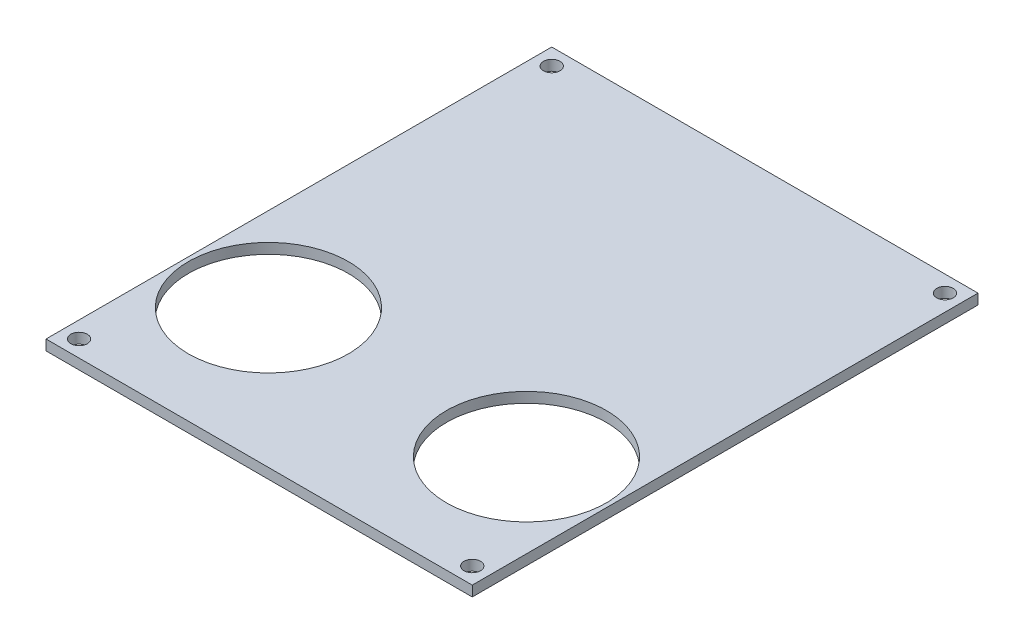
ISO-10303-21;
HEADER;
FILE_DESCRIPTION(('STEP AP214'),'2;1');
FILE_NAME('part.step','',(''),(''),'','','');
FILE_SCHEMA(('AUTOMOTIVE_DESIGN { 1 0 10303 214 1 1 1 1 }'));
ENDSEC;
DATA;
#1=APPLICATION_CONTEXT('core data for automotive mechanical design processes');
#2=APPLICATION_PROTOCOL_DEFINITION('international standard','automotive_design',2000,#1);
#3=PRODUCT_CONTEXT('',#1,'mechanical');
#4=PRODUCT('Part','Part','',(#3));
#5=PRODUCT_RELATED_PRODUCT_CATEGORY('part','',(#4));
#6=PRODUCT_DEFINITION_FORMATION('','',#4);
#7=PRODUCT_DEFINITION_CONTEXT('part definition',#1,'design');
#8=PRODUCT_DEFINITION('design','',#6,#7);
#9=PRODUCT_DEFINITION_SHAPE('','',#8);
#10=(LENGTH_UNIT() NAMED_UNIT(*) SI_UNIT(.MILLI.,.METRE.));
#11=(NAMED_UNIT(*) PLANE_ANGLE_UNIT() SI_UNIT($,.RADIAN.));
#12=(NAMED_UNIT(*) SI_UNIT($,.STERADIAN.) SOLID_ANGLE_UNIT());
#13=UNCERTAINTY_MEASURE_WITH_UNIT(LENGTH_MEASURE(1.E-05),#10,'distance_accuracy_value','');
#14=(GEOMETRIC_REPRESENTATION_CONTEXT(3) GLOBAL_UNCERTAINTY_ASSIGNED_CONTEXT((#13)) GLOBAL_UNIT_ASSIGNED_CONTEXT((#10,
#11,#12)) REPRESENTATION_CONTEXT('',''));
#15=CARTESIAN_POINT('',(0.,0.,0.));
#16=DIRECTION('',(0.,0.,1.));
#17=DIRECTION('',(1.,0.,0.));
#18=AXIS2_PLACEMENT_3D('',#15,#16,#17);
#19=CARTESIAN_POINT('',(-41.3,2.,-49.));
#20=DIRECTION('',(1.,0.,0.));
#21=DIRECTION('',(0.,0.,-1.));
#22=AXIS2_PLACEMENT_3D('',#19,#20,#21);
#23=PLANE('',#22);
#24=DIRECTION('',(0.,0.,1.));
#25=VECTOR('',#24,1.);
#26=CARTESIAN_POINT('',(-41.3,0.,-49.));
#27=LINE('',#26,#25);
#28=CARTESIAN_POINT('',(-41.3,0.,-49.));
#29=VERTEX_POINT('',#28);
#30=CARTESIAN_POINT('',(-41.3,0.,49.));
#31=VERTEX_POINT('',#30);
#32=EDGE_CURVE('E96',#29,#31,#27,.T.);
#33=ORIENTED_EDGE('',*,*,#32,.T.);
#34=DIRECTION('',(0.,-1.,0.));
#35=VECTOR('',#34,1.);
#36=CARTESIAN_POINT('',(-41.3,2.,49.));
#37=LINE('',#36,#35);
#38=CARTESIAN_POINT('',(-41.3,2.,49.));
#39=VERTEX_POINT('',#38);
#40=EDGE_CURVE('E11',#39,#31,#37,.T.);
#41=ORIENTED_EDGE('',*,*,#40,.F.);
#42=DIRECTION('',(0.,0.,1.));
#43=VECTOR('',#42,1.);
#44=CARTESIAN_POINT('',(-41.3,2.,-49.));
#45=LINE('',#44,#43);
#46=CARTESIAN_POINT('',(-41.3,2.,-49.));
#47=VERTEX_POINT('',#46);
#48=EDGE_CURVE('E84',#47,#39,#45,.T.);
#49=ORIENTED_EDGE('',*,*,#48,.F.);
#50=DIRECTION('',(0.,-1.,0.));
#51=VECTOR('',#50,1.);
#52=CARTESIAN_POINT('',(-41.3,2.,-49.));
#53=LINE('',#52,#51);
#54=EDGE_CURVE('E92',#47,#29,#53,.T.);
#55=ORIENTED_EDGE('',*,*,#54,.T.);
#56=EDGE_LOOP('',(#33,#41,#49,#55));
#57=FACE_BOUND('',#56,.T.);
#58=ADVANCED_FACE('F33',(#57),#23,.F.);
#59=CARTESIAN_POINT('',(41.3,2.,49.));
#60=DIRECTION('',(0.,0.,-1.));
#61=DIRECTION('',(-1.,0.,0.));
#62=AXIS2_PLACEMENT_3D('',#59,#60,#61);
#63=PLANE('',#62);
#64=DIRECTION('',(1.,0.,0.));
#65=VECTOR('',#64,1.);
#66=CARTESIAN_POINT('',(41.3,0.,49.));
#67=LINE('',#66,#65);
#68=CARTESIAN_POINT('',(41.3,0.,49.));
#69=VERTEX_POINT('',#68);
#70=EDGE_CURVE('E88',#31,#69,#67,.T.);
#71=ORIENTED_EDGE('',*,*,#70,.T.);
#72=DIRECTION('',(0.,-1.,0.));
#73=VECTOR('',#72,1.);
#74=CARTESIAN_POINT('',(41.3,2.,49.));
#75=LINE('',#74,#73);
#76=CARTESIAN_POINT('',(41.3,2.,49.));
#77=VERTEX_POINT('',#76);
#78=EDGE_CURVE('E41',#77,#69,#75,.T.);
#79=ORIENTED_EDGE('',*,*,#78,.F.);
#80=DIRECTION('',(1.,0.,0.));
#81=VECTOR('',#80,1.);
#82=CARTESIAN_POINT('',(41.3,2.,49.));
#83=LINE('',#82,#81);
#84=EDGE_CURVE('E79',#39,#77,#83,.T.);
#85=ORIENTED_EDGE('',*,*,#84,.F.);
#86=ORIENTED_EDGE('',*,*,#40,.T.);
#87=EDGE_LOOP('',(#71,#79,#85,#86));
#88=FACE_BOUND('',#87,.T.);
#89=ADVANCED_FACE('F87',(#88),#63,.F.);
#90=CARTESIAN_POINT('',(41.3,2.,-49.));
#91=DIRECTION('',(-1.,0.,0.));
#92=DIRECTION('',(0.,0.,1.));
#93=AXIS2_PLACEMENT_3D('',#90,#91,#92);
#94=PLANE('',#93);
#95=DIRECTION('',(0.,0.,-1.));
#96=VECTOR('',#95,1.);
#97=CARTESIAN_POINT('',(41.3,0.,-49.));
#98=LINE('',#97,#96);
#99=CARTESIAN_POINT('',(41.3,0.,-49.));
#100=VERTEX_POINT('',#99);
#101=EDGE_CURVE('E66',#69,#100,#98,.T.);
#102=ORIENTED_EDGE('',*,*,#101,.T.);
#103=DIRECTION('',(0.,-1.,0.));
#104=VECTOR('',#103,1.);
#105=CARTESIAN_POINT('',(41.3,2.,-49.));
#106=LINE('',#105,#104);
#107=CARTESIAN_POINT('',(41.3,2.,-49.));
#108=VERTEX_POINT('',#107);
#109=EDGE_CURVE('E89',#108,#100,#106,.T.);
#110=ORIENTED_EDGE('',*,*,#109,.F.);
#111=DIRECTION('',(0.,0.,-1.));
#112=VECTOR('',#111,1.);
#113=CARTESIAN_POINT('',(41.3,2.,-49.));
#114=LINE('',#113,#112);
#115=EDGE_CURVE('E82',#77,#108,#114,.T.);
#116=ORIENTED_EDGE('',*,*,#115,.F.);
#117=ORIENTED_EDGE('',*,*,#78,.T.);
#118=EDGE_LOOP('',(#102,#110,#116,#117));
#119=FACE_BOUND('',#118,.T.);
#120=ADVANCED_FACE('F90',(#119),#94,.F.);
#121=CARTESIAN_POINT('',(41.3,2.,-49.));
#122=DIRECTION('',(0.,0.,1.));
#123=DIRECTION('',(1.,0.,0.));
#124=AXIS2_PLACEMENT_3D('',#121,#122,#123);
#125=PLANE('',#124);
#126=DIRECTION('',(-1.,0.,0.));
#127=VECTOR('',#126,1.);
#128=CARTESIAN_POINT('',(41.3,0.,-49.));
#129=LINE('',#128,#127);
#130=EDGE_CURVE('E72',#100,#29,#129,.T.);
#131=ORIENTED_EDGE('',*,*,#130,.T.);
#132=ORIENTED_EDGE('',*,*,#54,.F.);
#133=DIRECTION('',(-1.,0.,0.));
#134=VECTOR('',#133,1.);
#135=CARTESIAN_POINT('',(41.3,2.,-49.));
#136=LINE('',#135,#134);
#137=EDGE_CURVE('E49',#108,#47,#136,.T.);
#138=ORIENTED_EDGE('',*,*,#137,.F.);
#139=ORIENTED_EDGE('',*,*,#109,.T.);
#140=EDGE_LOOP('',(#131,#132,#138,#139));
#141=FACE_BOUND('',#140,.T.);
#142=ADVANCED_FACE('F104',(#141),#125,.F.);
#143=CARTESIAN_POINT('',(0.,2.,0.));
#144=DIRECTION('',(0.,-1.,0.));
#145=DIRECTION('',(0.,0.,-1.));
#146=AXIS2_PLACEMENT_3D('',#143,#144,#145);
#147=PLANE('',#146);
#148=CARTESIAN_POINT('',(25.,2.,22.2));
#149=DIRECTION('',(0.,1.,0.));
#150=DIRECTION('',(0.,0.,1.));
#151=AXIS2_PLACEMENT_3D('',#148,#149,#150);
#152=CIRCLE('',#151,15.5);
#153=CARTESIAN_POINT('',(25.,2.,37.7));
#154=VERTEX_POINT('',#153);
#155=EDGE_CURVE('E140',#154,#154,#152,.T.);
#156=ORIENTED_EDGE('',*,*,#155,.F.);
#157=EDGE_LOOP('',(#156));
#158=FACE_BOUND('',#157,.T.);
#159=CARTESIAN_POINT('',(-25.,2.,22.2));
#160=DIRECTION('',(0.,1.,0.));
#161=DIRECTION('',(0.,0.,1.));
#162=AXIS2_PLACEMENT_3D('',#159,#160,#161);
#163=CIRCLE('',#162,15.5);
#164=CARTESIAN_POINT('',(-25.,2.,37.7));
#165=VERTEX_POINT('',#164);
#166=EDGE_CURVE('E134',#165,#165,#163,.T.);
#167=ORIENTED_EDGE('',*,*,#166,.F.);
#168=EDGE_LOOP('',(#167));
#169=FACE_BOUND('',#168,.T.);
#170=CARTESIAN_POINT('',(-38.1,2.,-45.8));
#171=DIRECTION('',(0.,1.,0.));
#172=DIRECTION('',(0.,0.,1.));
#173=AXIS2_PLACEMENT_3D('',#170,#171,#172);
#174=CIRCLE('',#173,1.59999999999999);
#175=CARTESIAN_POINT('',(-38.1,2.,-44.2));
#176=VERTEX_POINT('',#175);
#177=EDGE_CURVE('E130',#176,#176,#174,.T.);
#178=ORIENTED_EDGE('',*,*,#177,.F.);
#179=EDGE_LOOP('',(#178));
#180=FACE_BOUND('',#179,.T.);
#181=CARTESIAN_POINT('',(38.1,2.,-45.8));
#182=DIRECTION('',(0.,1.,0.));
#183=DIRECTION('',(0.,0.,1.));
#184=AXIS2_PLACEMENT_3D('',#181,#182,#183);
#185=CIRCLE('',#184,1.59999999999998);
#186=CARTESIAN_POINT('',(38.1,2.,-44.2));
#187=VERTEX_POINT('',#186);
#188=EDGE_CURVE('E124',#187,#187,#185,.T.);
#189=ORIENTED_EDGE('',*,*,#188,.F.);
#190=EDGE_LOOP('',(#189));
#191=FACE_BOUND('',#190,.T.);
#192=CARTESIAN_POINT('',(38.1,2.,45.8));
#193=DIRECTION('',(0.,1.,0.));
#194=DIRECTION('',(0.,0.,1.));
#195=AXIS2_PLACEMENT_3D('',#192,#193,#194);
#196=CIRCLE('',#195,1.59999999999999);
#197=CARTESIAN_POINT('',(38.1,2.,47.4));
#198=VERTEX_POINT('',#197);
#199=EDGE_CURVE('E118',#198,#198,#196,.T.);
#200=ORIENTED_EDGE('',*,*,#199,.F.);
#201=EDGE_LOOP('',(#200));
#202=FACE_BOUND('',#201,.T.);
#203=CARTESIAN_POINT('',(-38.1,2.,45.8));
#204=DIRECTION('',(0.,1.,0.));
#205=DIRECTION('',(0.,0.,1.));
#206=AXIS2_PLACEMENT_3D('',#203,#204,#205);
#207=CIRCLE('',#206,1.59999999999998);
#208=CARTESIAN_POINT('',(-38.1,2.,47.4));
#209=VERTEX_POINT('',#208);
#210=EDGE_CURVE('E112',#209,#209,#207,.T.);
#211=ORIENTED_EDGE('',*,*,#210,.F.);
#212=EDGE_LOOP('',(#211));
#213=FACE_BOUND('',#212,.T.);
#214=ORIENTED_EDGE('',*,*,#48,.T.);
#215=ORIENTED_EDGE('',*,*,#84,.T.);
#216=ORIENTED_EDGE('',*,*,#115,.T.);
#217=ORIENTED_EDGE('',*,*,#137,.T.);
#218=EDGE_LOOP('',(#214,#215,#216,#217));
#219=FACE_BOUND('',#218,.T.);
#220=ADVANCED_FACE('F80',(#158,#169,#180,#191,#202,#213,#219),#147,.F.);
#221=CARTESIAN_POINT('',(0.,0.,0.));
#222=DIRECTION('',(0.,-1.,0.));
#223=DIRECTION('',(0.,0.,-1.));
#224=AXIS2_PLACEMENT_3D('',#221,#222,#223);
#225=PLANE('',#224);
#226=CARTESIAN_POINT('',(25.,0.,22.2));
#227=DIRECTION('',(0.,1.,0.));
#228=DIRECTION('',(0.,0.,1.));
#229=AXIS2_PLACEMENT_3D('',#226,#227,#228);
#230=CIRCLE('',#229,15.5);
#231=CARTESIAN_POINT('',(25.,0.,37.7));
#232=VERTEX_POINT('',#231);
#233=EDGE_CURVE('E137',#232,#232,#230,.T.);
#234=ORIENTED_EDGE('',*,*,#233,.T.);
#235=EDGE_LOOP('',(#234));
#236=FACE_BOUND('',#235,.T.);
#237=CARTESIAN_POINT('',(-25.,0.,22.2));
#238=DIRECTION('',(0.,1.,0.));
#239=DIRECTION('',(0.,0.,1.));
#240=AXIS2_PLACEMENT_3D('',#237,#238,#239);
#241=CIRCLE('',#240,15.5);
#242=CARTESIAN_POINT('',(-25.,0.,37.7));
#243=VERTEX_POINT('',#242);
#244=EDGE_CURVE('E133',#243,#243,#241,.T.);
#245=ORIENTED_EDGE('',*,*,#244,.T.);
#246=EDGE_LOOP('',(#245));
#247=FACE_BOUND('',#246,.T.);
#248=CARTESIAN_POINT('',(-38.1,0.,-45.8));
#249=DIRECTION('',(0.,1.,0.));
#250=DIRECTION('',(0.,0.,1.));
#251=AXIS2_PLACEMENT_3D('',#248,#249,#250);
#252=CIRCLE('',#251,1.59999999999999);
#253=CARTESIAN_POINT('',(-38.1,0.,-44.2));
#254=VERTEX_POINT('',#253);
#255=EDGE_CURVE('E127',#254,#254,#252,.T.);
#256=ORIENTED_EDGE('',*,*,#255,.T.);
#257=EDGE_LOOP('',(#256));
#258=FACE_BOUND('',#257,.T.);
#259=CARTESIAN_POINT('',(38.1,0.,-45.8));
#260=DIRECTION('',(0.,1.,0.));
#261=DIRECTION('',(0.,0.,1.));
#262=AXIS2_PLACEMENT_3D('',#259,#260,#261);
#263=CIRCLE('',#262,1.59999999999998);
#264=CARTESIAN_POINT('',(38.1,0.,-44.2));
#265=VERTEX_POINT('',#264);
#266=EDGE_CURVE('E121',#265,#265,#263,.T.);
#267=ORIENTED_EDGE('',*,*,#266,.T.);
#268=EDGE_LOOP('',(#267));
#269=FACE_BOUND('',#268,.T.);
#270=CARTESIAN_POINT('',(38.1,0.,45.8));
#271=DIRECTION('',(0.,1.,0.));
#272=DIRECTION('',(0.,0.,1.));
#273=AXIS2_PLACEMENT_3D('',#270,#271,#272);
#274=CIRCLE('',#273,1.59999999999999);
#275=CARTESIAN_POINT('',(38.1,0.,47.4));
#276=VERTEX_POINT('',#275);
#277=EDGE_CURVE('E115',#276,#276,#274,.T.);
#278=ORIENTED_EDGE('',*,*,#277,.T.);
#279=EDGE_LOOP('',(#278));
#280=FACE_BOUND('',#279,.T.);
#281=CARTESIAN_POINT('',(-38.1,0.,45.8));
#282=DIRECTION('',(0.,1.,0.));
#283=DIRECTION('',(0.,0.,1.));
#284=AXIS2_PLACEMENT_3D('',#281,#282,#283);
#285=CIRCLE('',#284,1.59999999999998);
#286=CARTESIAN_POINT('',(-38.1,0.,47.4));
#287=VERTEX_POINT('',#286);
#288=EDGE_CURVE('E99',#287,#287,#285,.T.);
#289=ORIENTED_EDGE('',*,*,#288,.T.);
#290=EDGE_LOOP('',(#289));
#291=FACE_BOUND('',#290,.T.);
#292=ORIENTED_EDGE('',*,*,#32,.F.);
#293=ORIENTED_EDGE('',*,*,#130,.F.);
#294=ORIENTED_EDGE('',*,*,#101,.F.);
#295=ORIENTED_EDGE('',*,*,#70,.F.);
#296=EDGE_LOOP('',(#292,#293,#294,#295));
#297=FACE_BOUND('',#296,.T.);
#298=ADVANCED_FACE('F107',(#236,#247,#258,#269,#280,#291,#297),#225,.T.);
#299=CARTESIAN_POINT('',(-38.1,2.,45.8));
#300=DIRECTION('',(0.,1.,0.));
#301=DIRECTION('',(0.,0.,1.));
#302=AXIS2_PLACEMENT_3D('',#299,#300,#301);
#303=CYLINDRICAL_SURFACE('',#302,1.59999999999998);
#304=ORIENTED_EDGE('',*,*,#288,.F.);
#305=EDGE_LOOP('',(#304));
#306=FACE_BOUND('',#305,.T.);
#307=ORIENTED_EDGE('',*,*,#210,.T.);
#308=EDGE_LOOP('',(#307));
#309=FACE_BOUND('',#308,.T.);
#310=ADVANCED_FACE('F168',(#306,#309),#303,.F.);
#311=CARTESIAN_POINT('',(38.1,2.,45.8));
#312=DIRECTION('',(0.,1.,0.));
#313=DIRECTION('',(0.,0.,1.));
#314=AXIS2_PLACEMENT_3D('',#311,#312,#313);
#315=CYLINDRICAL_SURFACE('',#314,1.59999999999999);
#316=ORIENTED_EDGE('',*,*,#277,.F.);
#317=EDGE_LOOP('',(#316));
#318=FACE_BOUND('',#317,.T.);
#319=ORIENTED_EDGE('',*,*,#199,.T.);
#320=EDGE_LOOP('',(#319));
#321=FACE_BOUND('',#320,.T.);
#322=ADVANCED_FACE('F170',(#318,#321),#315,.F.);
#323=CARTESIAN_POINT('',(38.1,2.,-45.8));
#324=DIRECTION('',(0.,1.,0.));
#325=DIRECTION('',(0.,0.,1.));
#326=AXIS2_PLACEMENT_3D('',#323,#324,#325);
#327=CYLINDRICAL_SURFACE('',#326,1.59999999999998);
#328=ORIENTED_EDGE('',*,*,#266,.F.);
#329=EDGE_LOOP('',(#328));
#330=FACE_BOUND('',#329,.T.);
#331=ORIENTED_EDGE('',*,*,#188,.T.);
#332=EDGE_LOOP('',(#331));
#333=FACE_BOUND('',#332,.T.);
#334=ADVANCED_FACE('F177',(#330,#333),#327,.F.);
#335=CARTESIAN_POINT('',(-38.1,2.,-45.8));
#336=DIRECTION('',(0.,1.,0.));
#337=DIRECTION('',(0.,0.,1.));
#338=AXIS2_PLACEMENT_3D('',#335,#336,#337);
#339=CYLINDRICAL_SURFACE('',#338,1.59999999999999);
#340=ORIENTED_EDGE('',*,*,#255,.F.);
#341=EDGE_LOOP('',(#340));
#342=FACE_BOUND('',#341,.T.);
#343=ORIENTED_EDGE('',*,*,#177,.T.);
#344=EDGE_LOOP('',(#343));
#345=FACE_BOUND('',#344,.T.);
#346=ADVANCED_FACE('F215',(#342,#345),#339,.F.);
#347=CARTESIAN_POINT('',(-25.,0.,22.2));
#348=DIRECTION('',(0.,1.,0.));
#349=DIRECTION('',(0.,0.,1.));
#350=AXIS2_PLACEMENT_3D('',#347,#348,#349);
#351=CYLINDRICAL_SURFACE('',#350,15.5);
#352=ORIENTED_EDGE('',*,*,#244,.F.);
#353=EDGE_LOOP('',(#352));
#354=FACE_BOUND('',#353,.T.);
#355=ORIENTED_EDGE('',*,*,#166,.T.);
#356=EDGE_LOOP('',(#355));
#357=FACE_BOUND('',#356,.T.);
#358=ADVANCED_FACE('F151',(#354,#357),#351,.F.);
#359=CARTESIAN_POINT('',(25.,0.,22.2));
#360=DIRECTION('',(0.,1.,0.));
#361=DIRECTION('',(0.,0.,1.));
#362=AXIS2_PLACEMENT_3D('',#359,#360,#361);
#363=CYLINDRICAL_SURFACE('',#362,15.5);
#364=ORIENTED_EDGE('',*,*,#233,.F.);
#365=EDGE_LOOP('',(#364));
#366=FACE_BOUND('',#365,.T.);
#367=ORIENTED_EDGE('',*,*,#155,.T.);
#368=EDGE_LOOP('',(#367));
#369=FACE_BOUND('',#368,.T.);
#370=ADVANCED_FACE('F148',(#366,#369),#363,.F.);
#371=CLOSED_SHELL('',(#58,#89,#120,#142,#220,#298,#310,#322,#334,#346,#358,#370));
#372=MANIFOLD_SOLID_BREP('B2',#371);
#373=ADVANCED_BREP_SHAPE_REPRESENTATION('',(#18,#372),#14);
#374=SHAPE_DEFINITION_REPRESENTATION(#9,#373);
ENDSEC;
END-ISO-10303-21;
